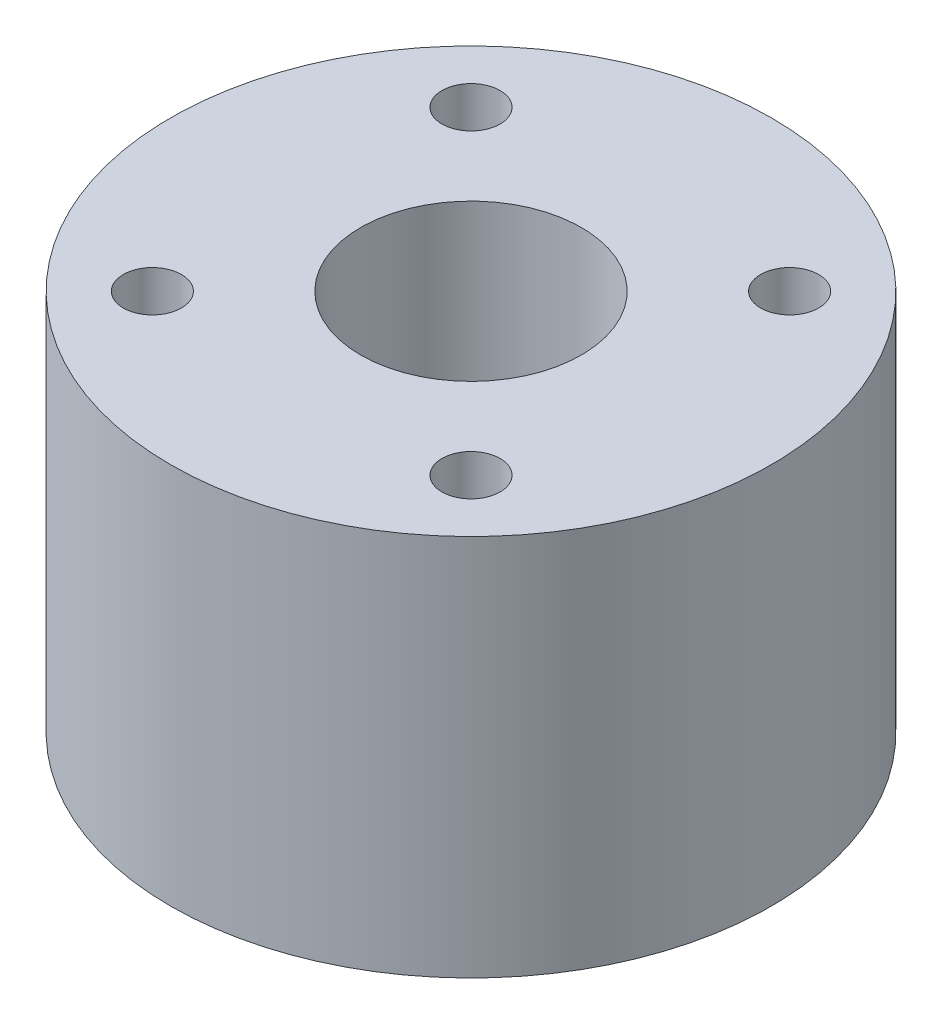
ISO-10303-21;
HEADER;
FILE_DESCRIPTION(('STEP AP214'),'2;1');
FILE_NAME('part.step','',(''),(''),'','','');
FILE_SCHEMA(('AUTOMOTIVE_DESIGN { 1 0 10303 214 1 1 1 1 }'));
ENDSEC;
DATA;
#1=APPLICATION_CONTEXT('core data for automotive mechanical design processes');
#2=APPLICATION_PROTOCOL_DEFINITION('international standard','automotive_design',2000,#1);
#3=PRODUCT_CONTEXT('',#1,'mechanical');
#4=PRODUCT('Part','Part','',(#3));
#5=PRODUCT_RELATED_PRODUCT_CATEGORY('part','',(#4));
#6=PRODUCT_DEFINITION_FORMATION('','',#4);
#7=PRODUCT_DEFINITION_CONTEXT('part definition',#1,'design');
#8=PRODUCT_DEFINITION('design','',#6,#7);
#9=PRODUCT_DEFINITION_SHAPE('','',#8);
#10=(LENGTH_UNIT() NAMED_UNIT(*) SI_UNIT(.MILLI.,.METRE.));
#11=(NAMED_UNIT(*) PLANE_ANGLE_UNIT() SI_UNIT($,.RADIAN.));
#12=(NAMED_UNIT(*) SI_UNIT($,.STERADIAN.) SOLID_ANGLE_UNIT());
#13=UNCERTAINTY_MEASURE_WITH_UNIT(LENGTH_MEASURE(1.E-05),#10,'distance_accuracy_value','');
#14=(GEOMETRIC_REPRESENTATION_CONTEXT(3) GLOBAL_UNCERTAINTY_ASSIGNED_CONTEXT((#13)) GLOBAL_UNIT_ASSIGNED_CONTEXT((#10,
#11,#12)) REPRESENTATION_CONTEXT('',''));
#15=CARTESIAN_POINT('',(0.,0.,0.));
#16=DIRECTION('',(0.,0.,1.));
#17=DIRECTION('',(1.,0.,0.));
#18=AXIS2_PLACEMENT_3D('',#15,#16,#17);
#19=CARTESIAN_POINT('',(0.,-44.46016,0.));
#20=DIRECTION('',(0.,1.,0.));
#21=DIRECTION('',(0.,0.,1.));
#22=AXIS2_PLACEMENT_3D('',#19,#20,#21);
#23=CYLINDRICAL_SURFACE('',#22,34.925);
#24=CARTESIAN_POINT('',(0.,-44.46016,0.));
#25=DIRECTION('',(0.,-1.,0.));
#26=DIRECTION('',(0.,0.,-1.));
#27=AXIS2_PLACEMENT_3D('',#24,#25,#26);
#28=CIRCLE('',#27,34.925);
#29=CARTESIAN_POINT('',(0.,-44.46016,34.925));
#30=VERTEX_POINT('',#29);
#31=EDGE_CURVE('E10',#30,#30,#28,.T.);
#32=CARTESIAN_POINT('',(0.,-0.01016,0.));
#33=DIRECTION('',(0.,-1.,0.));
#34=DIRECTION('',(0.,0.,-1.));
#35=AXIS2_PLACEMENT_3D('',#32,#33,#34);
#36=CIRCLE('',#35,34.925);
#37=CARTESIAN_POINT('',(0.,-0.0101600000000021,34.925));
#38=VERTEX_POINT('',#37);
#39=EDGE_CURVE('E35',#38,#38,#36,.T.);
#40=CARTESIAN_POINT('',(0.,-44.46016,34.925));
#41=CARTESIAN_POINT('',(0.,-43.9971391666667,34.925));
#42=CARTESIAN_POINT('',(0.,-43.5341183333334,34.925));
#43=CARTESIAN_POINT('',(0.,-42.6080766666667,34.925));
#44=CARTESIAN_POINT('',(0.,-42.1450558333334,34.925));
#45=CARTESIAN_POINT('',(0.,-41.2190141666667,34.925));
#46=CARTESIAN_POINT('',(0.,-40.7559933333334,34.925));
#47=CARTESIAN_POINT('',(0.,-39.8299516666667,34.925));
#48=CARTESIAN_POINT('',(0.,-39.3669308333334,34.925));
#49=CARTESIAN_POINT('',(0.,-38.4408891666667,34.925));
#50=CARTESIAN_POINT('',(0.,-37.9778683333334,34.925));
#51=CARTESIAN_POINT('',(0.,-37.0518266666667,34.925));
#52=CARTESIAN_POINT('',(0.,-36.5888058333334,34.925));
#53=CARTESIAN_POINT('',(0.,-35.6627641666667,34.925));
#54=CARTESIAN_POINT('',(0.,-35.1997433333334,34.925));
#55=CARTESIAN_POINT('',(0.,-34.2737016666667,34.925));
#56=CARTESIAN_POINT('',(0.,-33.8106808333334,34.925));
#57=CARTESIAN_POINT('',(0.,-32.8846391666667,34.925));
#58=CARTESIAN_POINT('',(0.,-32.4216183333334,34.925));
#59=CARTESIAN_POINT('',(0.,-31.4955766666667,34.925));
#60=CARTESIAN_POINT('',(0.,-31.0325558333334,34.925));
#61=CARTESIAN_POINT('',(0.,-30.1065141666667,34.925));
#62=CARTESIAN_POINT('',(0.,-29.6434933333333,34.925));
#63=CARTESIAN_POINT('',(0.,-28.7174516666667,34.925));
#64=CARTESIAN_POINT('',(0.,-28.2544308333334,34.925));
#65=CARTESIAN_POINT('',(0.,-27.3283891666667,34.925));
#66=CARTESIAN_POINT('',(0.,-26.8653683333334,34.925));
#67=CARTESIAN_POINT('',(0.,-25.9393266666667,34.925));
#68=CARTESIAN_POINT('',(0.,-25.4763058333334,34.925));
#69=CARTESIAN_POINT('',(0.,-24.5502641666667,34.925));
#70=CARTESIAN_POINT('',(0.,-24.0872433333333,34.925));
#71=CARTESIAN_POINT('',(0.,-23.1612016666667,34.925));
#72=CARTESIAN_POINT('',(0.,-22.6981808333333,34.925));
#73=CARTESIAN_POINT('',(0.,-21.7721391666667,34.925));
#74=CARTESIAN_POINT('',(0.,-21.3091183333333,34.925));
#75=CARTESIAN_POINT('',(0.,-20.3830766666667,34.925));
#76=CARTESIAN_POINT('',(0.,-19.9200558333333,34.925));
#77=CARTESIAN_POINT('',(0.,-18.9940141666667,34.925));
#78=CARTESIAN_POINT('',(0.,-18.5309933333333,34.925));
#79=CARTESIAN_POINT('',(0.,-17.6049516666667,34.925));
#80=CARTESIAN_POINT('',(0.,-17.1419308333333,34.925));
#81=CARTESIAN_POINT('',(0.,-16.2158891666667,34.925));
#82=CARTESIAN_POINT('',(0.,-15.7528683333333,34.925));
#83=CARTESIAN_POINT('',(0.,-14.8268266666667,34.925));
#84=CARTESIAN_POINT('',(0.,-14.3638058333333,34.925));
#85=CARTESIAN_POINT('',(0.,-13.4377641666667,34.925));
#86=CARTESIAN_POINT('',(0.,-12.9747433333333,34.925));
#87=CARTESIAN_POINT('',(0.,-12.0487016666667,34.925));
#88=CARTESIAN_POINT('',(0.,-11.5856808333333,34.925));
#89=CARTESIAN_POINT('',(0.,-10.6596391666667,34.925));
#90=CARTESIAN_POINT('',(0.,-10.1966183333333,34.925));
#91=CARTESIAN_POINT('',(0.,-9.27057666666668,34.925));
#92=CARTESIAN_POINT('',(0.,-8.80755583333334,34.925));
#93=CARTESIAN_POINT('',(0.,-7.88151416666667,34.925));
#94=CARTESIAN_POINT('',(0.,-7.41849333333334,34.925));
#95=CARTESIAN_POINT('',(0.,-6.49245166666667,34.925));
#96=CARTESIAN_POINT('',(0.,-6.02943083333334,34.925));
#97=CARTESIAN_POINT('',(0.,-5.10338916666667,34.925));
#98=CARTESIAN_POINT('',(0.,-4.64036833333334,34.925));
#99=CARTESIAN_POINT('',(0.,-3.71432666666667,34.925));
#100=CARTESIAN_POINT('',(0.,-3.25130583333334,34.925));
#101=CARTESIAN_POINT('',(0.,-2.32526416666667,34.925));
#102=CARTESIAN_POINT('',(0.,-1.86224333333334,34.925));
#103=CARTESIAN_POINT('',(0.,-0.936201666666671,34.925));
#104=CARTESIAN_POINT('',(0.,-0.473180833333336,34.925));
#105=CARTESIAN_POINT('',(0.,-0.0101600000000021,34.925));
#106=B_SPLINE_CURVE_WITH_KNOTS('',3,(#40,#41,#42,#43,#44,#45,#46,#47,#48,#49,#50,#51,#52,#53,
#54,#55,#56,#57,#58,#59,#60,#61,#62,#63,#64,#65,#66,#67,#68,#69,#70,#71,#72,#73,#74,#75,#76,#77,
#78,#79,#80,#81,#82,#83,#84,#85,#86,#87,#88,#89,#90,#91,#92,#93,#94,#95,#96,#97,#98,#99,#100,
#101,#102,#103,#104,#105),.UNSPECIFIED.,.F.,.F.,(4,2,2,2,2,2,2,2,2,2,2,2,2,2,2,2,2,2,2,2,2,2,2,
2,2,2,2,2,2,2,2,2,4),(0.,1.3890625,2.778125,4.1671875,5.55625,6.9453125,8.334375,9.7234375,
11.1125,12.5015625,13.890625,15.2796875,16.66875,18.0578125,19.446875,20.8359375,22.225,
23.6140625,25.003125,26.3921875,27.78125,29.1703125,30.559375,31.9484375,33.3375,34.7265625,
36.115625,37.5046875,38.89375,40.2828125,41.671875,43.0609375,44.45),.UNSPECIFIED.);
#107=EDGE_CURVE('BSEAM32',#30,#38,#106,.T.);
#108=ORIENTED_EDGE('',*,*,#31,.F.);
#109=ORIENTED_EDGE('',*,*,#39,.T.);
#110=ORIENTED_EDGE('',*,*,#107,.T.);
#111=ORIENTED_EDGE('',*,*,#107,.F.);
#112=EDGE_LOOP('',(#108,#110,#109,#111));
#113=FACE_BOUND('',#112,.T.);
#114=ADVANCED_FACE('F32',(#113),#23,.T.);
#115=CARTESIAN_POINT('',(0.,-44.46016,0.));
#116=DIRECTION('',(0.,-1.,0.));
#117=DIRECTION('',(0.,0.,-1.));
#118=AXIS2_PLACEMENT_3D('',#115,#116,#117);
#119=PLANE('',#118);
#120=CARTESIAN_POINT('',(0.,-44.46016,0.));
#121=DIRECTION('',(0.,1.,0.));
#122=DIRECTION('',(0.,0.,1.));
#123=AXIS2_PLACEMENT_3D('',#120,#121,#122);
#124=CIRCLE('',#123,3.75596243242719);
#125=CARTESIAN_POINT('',(0.,-44.46016,3.75596243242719));
#126=VERTEX_POINT('',#125);
#127=EDGE_CURVE('E71',#126,#126,#124,.T.);
#128=ORIENTED_EDGE('',*,*,#127,.T.);
#129=EDGE_LOOP('',(#128));
#130=FACE_BOUND('',#129,.T.);
#131=CARTESIAN_POINT('',(-18.5217782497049,-44.46016,18.5217782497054));
#132=DIRECTION('',(0.,1.,0.));
#133=DIRECTION('',(0.,0.,1.));
#134=AXIS2_PLACEMENT_3D('',#131,#132,#133);
#135=CIRCLE('',#134,3.37819999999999);
#136=CARTESIAN_POINT('',(-18.5217782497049,-44.46016,21.8999782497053));
#137=VERTEX_POINT('',#136);
#138=EDGE_CURVE('E61',#137,#137,#135,.T.);
#139=ORIENTED_EDGE('',*,*,#138,.T.);
#140=EDGE_LOOP('',(#139));
#141=FACE_BOUND('',#140,.T.);
#142=CARTESIAN_POINT('',(-18.5217782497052,-44.46016,-18.5217782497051));
#143=DIRECTION('',(0.,1.,0.));
#144=DIRECTION('',(0.,0.,1.));
#145=AXIS2_PLACEMENT_3D('',#142,#143,#144);
#146=CIRCLE('',#145,3.37819999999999);
#147=CARTESIAN_POINT('',(-18.5217782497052,-44.46016,-15.1435782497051));
#148=VERTEX_POINT('',#147);
#149=EDGE_CURVE('E55',#148,#148,#146,.T.);
#150=ORIENTED_EDGE('',*,*,#149,.T.);
#151=EDGE_LOOP('',(#150));
#152=FACE_BOUND('',#151,.T.);
#153=CARTESIAN_POINT('',(18.521778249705,-44.46016,-18.5217782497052));
#154=DIRECTION('',(0.,1.,0.));
#155=DIRECTION('',(0.,0.,1.));
#156=AXIS2_PLACEMENT_3D('',#153,#154,#155);
#157=CIRCLE('',#156,3.37819999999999);
#158=CARTESIAN_POINT('',(18.521778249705,-44.46016,-15.1435782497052));
#159=VERTEX_POINT('',#158);
#160=EDGE_CURVE('E49',#159,#159,#157,.T.);
#161=ORIENTED_EDGE('',*,*,#160,.T.);
#162=EDGE_LOOP('',(#161));
#163=FACE_BOUND('',#162,.T.);
#164=CARTESIAN_POINT('',(18.5217782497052,-44.46016,18.5217782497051));
#165=DIRECTION('',(0.,1.,0.));
#166=DIRECTION('',(0.,0.,1.));
#167=AXIS2_PLACEMENT_3D('',#164,#165,#166);
#168=CIRCLE('',#167,3.37819999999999);
#169=CARTESIAN_POINT('',(18.5217782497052,-44.46016,21.8999782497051));
#170=VERTEX_POINT('',#169);
#171=EDGE_CURVE('E42',#170,#170,#168,.T.);
#172=ORIENTED_EDGE('',*,*,#171,.T.);
#173=EDGE_LOOP('',(#172));
#174=FACE_BOUND('',#173,.T.);
#175=ORIENTED_EDGE('',*,*,#31,.T.);
#176=EDGE_LOOP('',(#175));
#177=FACE_BOUND('',#176,.T.);
#178=ADVANCED_FACE('F80',(#130,#141,#152,#163,#174,#177),#119,.T.);
#179=CARTESIAN_POINT('',(0.,-0.01016,0.));
#180=DIRECTION('',(0.,-1.,0.));
#181=DIRECTION('',(0.,0.,-1.));
#182=AXIS2_PLACEMENT_3D('',#179,#180,#181);
#183=PLANE('',#182);
#184=CARTESIAN_POINT('',(0.,-0.01016,0.));
#185=DIRECTION('',(0.,1.,0.));
#186=DIRECTION('',(0.,0.,1.));
#187=AXIS2_PLACEMENT_3D('',#184,#185,#186);
#188=CIRCLE('',#187,12.8396559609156);
#189=CARTESIAN_POINT('',(0.,-0.01016,12.8396559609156));
#190=VERTEX_POINT('',#189);
#191=EDGE_CURVE('E68',#190,#190,#188,.T.);
#192=ORIENTED_EDGE('',*,*,#191,.F.);
#193=EDGE_LOOP('',(#192));
#194=FACE_BOUND('',#193,.T.);
#195=CARTESIAN_POINT('',(-18.5217782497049,-0.0101599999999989,18.5217782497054));
#196=DIRECTION('',(0.,1.,0.));
#197=DIRECTION('',(0.,0.,1.));
#198=AXIS2_PLACEMENT_3D('',#195,#196,#197);
#199=CIRCLE('',#198,3.37819999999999);
#200=CARTESIAN_POINT('',(-18.5217782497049,-0.0101599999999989,21.8999782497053));
#201=VERTEX_POINT('',#200);
#202=EDGE_CURVE('E64',#201,#201,#199,.T.);
#203=ORIENTED_EDGE('',*,*,#202,.F.);
#204=EDGE_LOOP('',(#203));
#205=FACE_BOUND('',#204,.T.);
#206=CARTESIAN_POINT('',(-18.5217782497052,-0.0101599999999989,-18.5217782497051));
#207=DIRECTION('',(0.,1.,0.));
#208=DIRECTION('',(0.,0.,1.));
#209=AXIS2_PLACEMENT_3D('',#206,#207,#208);
#210=CIRCLE('',#209,3.37819999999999);
#211=CARTESIAN_POINT('',(-18.5217782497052,-0.0101599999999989,-15.1435782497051));
#212=VERTEX_POINT('',#211);
#213=EDGE_CURVE('E58',#212,#212,#210,.T.);
#214=ORIENTED_EDGE('',*,*,#213,.F.);
#215=EDGE_LOOP('',(#214));
#216=FACE_BOUND('',#215,.T.);
#217=CARTESIAN_POINT('',(18.521778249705,-0.0101599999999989,-18.5217782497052));
#218=DIRECTION('',(0.,1.,0.));
#219=DIRECTION('',(0.,0.,1.));
#220=AXIS2_PLACEMENT_3D('',#217,#218,#219);
#221=CIRCLE('',#220,3.37819999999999);
#222=CARTESIAN_POINT('',(18.521778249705,-0.0101599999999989,-15.1435782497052));
#223=VERTEX_POINT('',#222);
#224=EDGE_CURVE('E52',#223,#223,#221,.T.);
#225=ORIENTED_EDGE('',*,*,#224,.F.);
#226=EDGE_LOOP('',(#225));
#227=FACE_BOUND('',#226,.T.);
#228=CARTESIAN_POINT('',(18.5217782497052,-0.0101599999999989,18.5217782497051));
#229=DIRECTION('',(0.,1.,0.));
#230=DIRECTION('',(0.,0.,1.));
#231=AXIS2_PLACEMENT_3D('',#228,#229,#230);
#232=CIRCLE('',#231,3.37819999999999);
#233=CARTESIAN_POINT('',(18.5217782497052,-0.0101599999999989,21.8999782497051));
#234=VERTEX_POINT('',#233);
#235=EDGE_CURVE('E46',#234,#234,#232,.T.);
#236=ORIENTED_EDGE('',*,*,#235,.F.);
#237=EDGE_LOOP('',(#236));
#238=FACE_BOUND('',#237,.T.);
#239=ORIENTED_EDGE('',*,*,#39,.F.);
#240=EDGE_LOOP('',(#239));
#241=FACE_BOUND('',#240,.T.);
#242=ADVANCED_FACE('F102',(#194,#205,#216,#227,#238,#241),#183,.F.);
#243=CARTESIAN_POINT('',(18.5217782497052,-0.01016,18.5217782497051));
#244=DIRECTION('',(0.,1.,0.));
#245=DIRECTION('',(0.,0.,1.));
#246=AXIS2_PLACEMENT_3D('',#243,#244,#245);
#247=CYLINDRICAL_SURFACE('',#246,3.37819999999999);
#248=ORIENTED_EDGE('',*,*,#171,.F.);
#249=EDGE_LOOP('',(#248));
#250=FACE_BOUND('',#249,.T.);
#251=ORIENTED_EDGE('',*,*,#235,.T.);
#252=EDGE_LOOP('',(#251));
#253=FACE_BOUND('',#252,.T.);
#254=ADVANCED_FACE('F105',(#250,#253),#247,.F.);
#255=CARTESIAN_POINT('',(18.521778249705,-0.01016,-18.5217782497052));
#256=DIRECTION('',(0.,1.,0.));
#257=DIRECTION('',(0.,0.,1.));
#258=AXIS2_PLACEMENT_3D('',#255,#256,#257);
#259=CYLINDRICAL_SURFACE('',#258,3.37819999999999);
#260=ORIENTED_EDGE('',*,*,#160,.F.);
#261=EDGE_LOOP('',(#260));
#262=FACE_BOUND('',#261,.T.);
#263=ORIENTED_EDGE('',*,*,#224,.T.);
#264=EDGE_LOOP('',(#263));
#265=FACE_BOUND('',#264,.T.);
#266=ADVANCED_FACE('F127',(#262,#265),#259,.F.);
#267=CARTESIAN_POINT('',(-18.5217782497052,-0.01016,-18.5217782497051));
#268=DIRECTION('',(0.,1.,0.));
#269=DIRECTION('',(0.,0.,1.));
#270=AXIS2_PLACEMENT_3D('',#267,#268,#269);
#271=CYLINDRICAL_SURFACE('',#270,3.37819999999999);
#272=ORIENTED_EDGE('',*,*,#149,.F.);
#273=EDGE_LOOP('',(#272));
#274=FACE_BOUND('',#273,.T.);
#275=ORIENTED_EDGE('',*,*,#213,.T.);
#276=EDGE_LOOP('',(#275));
#277=FACE_BOUND('',#276,.T.);
#278=ADVANCED_FACE('F131',(#274,#277),#271,.F.);
#279=CARTESIAN_POINT('',(-18.5217782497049,-0.01016,18.5217782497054));
#280=DIRECTION('',(0.,1.,0.));
#281=DIRECTION('',(0.,0.,1.));
#282=AXIS2_PLACEMENT_3D('',#279,#280,#281);
#283=CYLINDRICAL_SURFACE('',#282,3.37819999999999);
#284=ORIENTED_EDGE('',*,*,#138,.F.);
#285=EDGE_LOOP('',(#284));
#286=FACE_BOUND('',#285,.T.);
#287=ORIENTED_EDGE('',*,*,#202,.T.);
#288=EDGE_LOOP('',(#287));
#289=FACE_BOUND('',#288,.T.);
#290=ADVANCED_FACE('F98',(#286,#289),#283,.F.);
#291=CARTESIAN_POINT('',(0.,-32.55391,0.));
#292=DIRECTION('',(0.,1.,0.));
#293=DIRECTION('',(0.,0.,1.));
#294=AXIS2_PLACEMENT_3D('',#291,#292,#293);
#295=CYLINDRICAL_SURFACE('',#294,12.8396559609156);
#296=CARTESIAN_POINT('',(0.,-32.55391,0.));
#297=DIRECTION('',(0.,1.,0.));
#298=DIRECTION('',(0.,0.,1.));
#299=AXIS2_PLACEMENT_3D('',#296,#297,#298);
#300=CIRCLE('',#299,12.8396559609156);
#301=CARTESIAN_POINT('',(0.,-32.55391,12.8396559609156));
#302=VERTEX_POINT('',#301);
#303=EDGE_CURVE('E67',#302,#302,#300,.T.);
#304=ORIENTED_EDGE('',*,*,#303,.F.);
#305=EDGE_LOOP('',(#304));
#306=FACE_BOUND('',#305,.T.);
#307=ORIENTED_EDGE('',*,*,#191,.T.);
#308=EDGE_LOOP('',(#307));
#309=FACE_BOUND('',#308,.T.);
#310=ADVANCED_FACE('F92',(#306,#309),#295,.F.);
#311=CARTESIAN_POINT('',(0.,-32.55391,0.));
#312=DIRECTION('',(0.,1.,0.));
#313=DIRECTION('',(0.,0.,1.));
#314=AXIS2_PLACEMENT_3D('',#311,#312,#313);
#315=PLANE('',#314);
#316=CARTESIAN_POINT('',(0.,-32.55391,0.));
#317=DIRECTION('',(0.,1.,0.));
#318=DIRECTION('',(0.,0.,1.));
#319=AXIS2_PLACEMENT_3D('',#316,#317,#318);
#320=CIRCLE('',#319,3.75596243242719);
#321=CARTESIAN_POINT('',(0.,-32.55391,3.75596243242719));
#322=VERTEX_POINT('',#321);
#323=EDGE_CURVE('E74',#322,#322,#320,.T.);
#324=ORIENTED_EDGE('',*,*,#323,.F.);
#325=EDGE_LOOP('',(#324));
#326=FACE_BOUND('',#325,.T.);
#327=ORIENTED_EDGE('',*,*,#303,.T.);
#328=EDGE_LOOP('',(#327));
#329=FACE_BOUND('',#328,.T.);
#330=ADVANCED_FACE('F86',(#326,#329),#315,.T.);
#331=CARTESIAN_POINT('',(0.,-44.46016,0.));
#332=DIRECTION('',(0.,1.,0.));
#333=DIRECTION('',(0.,0.,1.));
#334=AXIS2_PLACEMENT_3D('',#331,#332,#333);
#335=CYLINDRICAL_SURFACE('',#334,3.75596243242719);
#336=ORIENTED_EDGE('',*,*,#127,.F.);
#337=EDGE_LOOP('',(#336));
#338=FACE_BOUND('',#337,.T.);
#339=ORIENTED_EDGE('',*,*,#323,.T.);
#340=EDGE_LOOP('',(#339));
#341=FACE_BOUND('',#340,.T.);
#342=ADVANCED_FACE('F83',(#338,#341),#335,.F.);
#343=CLOSED_SHELL('',(#114,#178,#242,#254,#266,#278,#290,#310,#330,#342));
#344=MANIFOLD_SOLID_BREP('B2',#343);
#345=ADVANCED_BREP_SHAPE_REPRESENTATION('',(#18,#344),#14);
#346=SHAPE_DEFINITION_REPRESENTATION(#9,#345);
ENDSEC;
END-ISO-10303-21;
